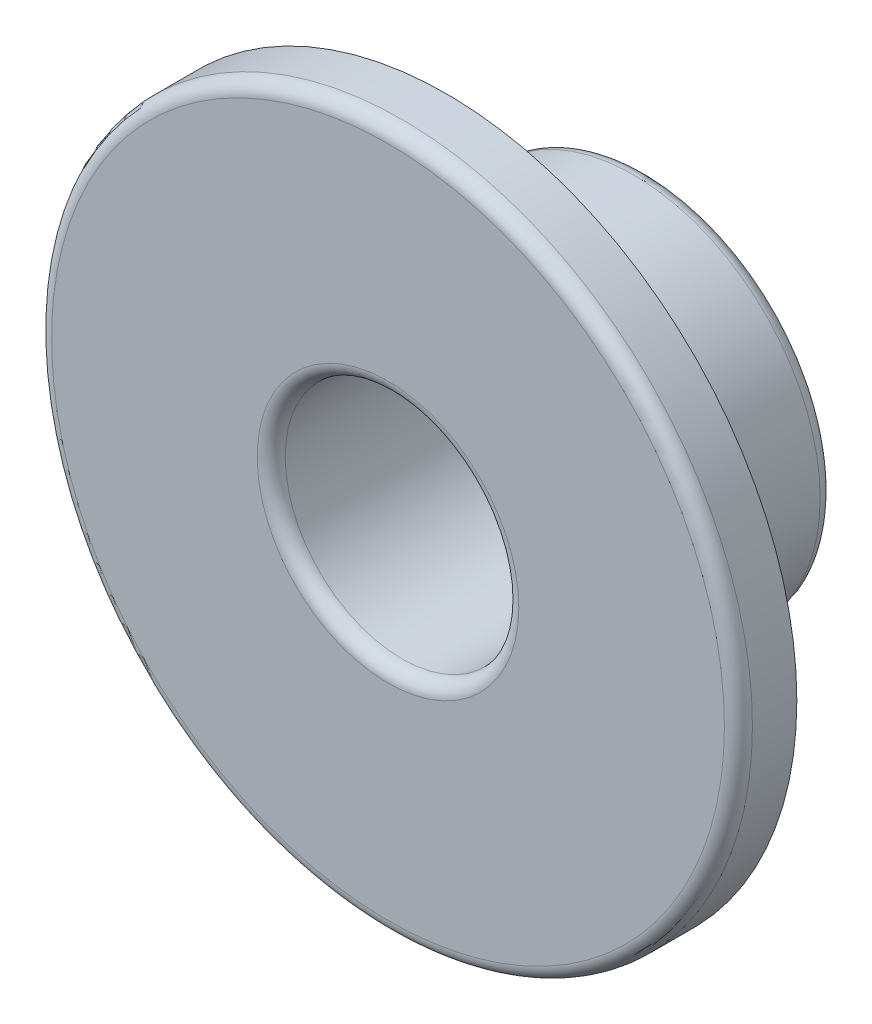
ISO-10303-21;
HEADER;
FILE_DESCRIPTION(('STEP AP214'),'2;1');
FILE_NAME('part.step','',(''),(''),'','','');
FILE_SCHEMA(('AUTOMOTIVE_DESIGN { 1 0 10303 214 1 1 1 1 }'));
ENDSEC;
DATA;
#1=APPLICATION_CONTEXT('core data for automotive mechanical design processes');
#2=APPLICATION_PROTOCOL_DEFINITION('international standard','automotive_design',2000,#1);
#3=PRODUCT_CONTEXT('',#1,'mechanical');
#4=PRODUCT('Part','Part','',(#3));
#5=PRODUCT_RELATED_PRODUCT_CATEGORY('part','',(#4));
#6=PRODUCT_DEFINITION_FORMATION('','',#4);
#7=PRODUCT_DEFINITION_CONTEXT('part definition',#1,'design');
#8=PRODUCT_DEFINITION('design','',#6,#7);
#9=PRODUCT_DEFINITION_SHAPE('','',#8);
#10=(LENGTH_UNIT() NAMED_UNIT(*) SI_UNIT(.MILLI.,.METRE.));
#11=(NAMED_UNIT(*) PLANE_ANGLE_UNIT() SI_UNIT($,.RADIAN.));
#12=(NAMED_UNIT(*) SI_UNIT($,.STERADIAN.) SOLID_ANGLE_UNIT());
#13=UNCERTAINTY_MEASURE_WITH_UNIT(LENGTH_MEASURE(1.E-05),#10,'distance_accuracy_value','');
#14=(GEOMETRIC_REPRESENTATION_CONTEXT(3) GLOBAL_UNCERTAINTY_ASSIGNED_CONTEXT((#13)) GLOBAL_UNIT_ASSIGNED_CONTEXT((#10,
#11,#12)) REPRESENTATION_CONTEXT('',''));
#15=CARTESIAN_POINT('',(0.,0.,0.));
#16=DIRECTION('',(0.,0.,1.));
#17=DIRECTION('',(1.,0.,0.));
#18=AXIS2_PLACEMENT_3D('',#15,#16,#17);
#19=CARTESIAN_POINT('',(0.,0.,0.));
#20=DIRECTION('',(0.,0.,1.));
#21=DIRECTION('',(1.,0.,0.));
#22=AXIS2_PLACEMENT_3D('',#19,#20,#21);
#23=PLANE('',#22);
#24=CARTESIAN_POINT('',(0.,0.,0.));
#25=DIRECTION('',(0.,0.,1.));
#26=DIRECTION('',(1.,0.,0.));
#27=AXIS2_PLACEMENT_3D('',#24,#25,#26);
#28=CIRCLE('',#27,19.05);
#29=CARTESIAN_POINT('',(19.05,0.,0.));
#30=VERTEX_POINT('',#29);
#31=EDGE_CURVE('E65',#30,#30,#28,.T.);
#32=ORIENTED_EDGE('',*,*,#31,.F.);
#33=EDGE_LOOP('',(#32));
#34=FACE_BOUND('',#33,.T.);
#35=CARTESIAN_POINT('',(0.,0.,0.));
#36=DIRECTION('',(0.,0.,1.));
#37=DIRECTION('',(1.,0.,0.));
#38=AXIS2_PLACEMENT_3D('',#35,#36,#37);
#39=CIRCLE('',#38,10.16);
#40=CARTESIAN_POINT('',(10.16,0.,0.));
#41=VERTEX_POINT('',#40);
#42=EDGE_CURVE('E62',#41,#41,#39,.F.);
#43=ORIENTED_EDGE('',*,*,#42,.F.);
#44=EDGE_LOOP('',(#43));
#45=FACE_BOUND('',#44,.T.);
#46=ADVANCED_FACE('F30',(#34,#45),#23,.F.);
#47=CARTESIAN_POINT('',(0.,0.,3.175));
#48=DIRECTION('',(0.,0.,-1.));
#49=DIRECTION('',(-1.,0.,0.));
#50=AXIS2_PLACEMENT_3D('',#47,#48,#49);
#51=CYLINDRICAL_SURFACE('',#50,19.05);
#52=CARTESIAN_POINT('',(0.,0.,2.413));
#53=DIRECTION('',(0.,0.,1.));
#54=DIRECTION('',(1.,0.,0.));
#55=AXIS2_PLACEMENT_3D('',#52,#53,#54);
#56=CIRCLE('',#55,19.05);
#57=CARTESIAN_POINT('',(19.05,0.,2.413));
#58=VERTEX_POINT('',#57);
#59=EDGE_CURVE('E37',#58,#58,#56,.F.);
#60=ORIENTED_EDGE('',*,*,#59,.T.);
#61=EDGE_LOOP('',(#60));
#62=FACE_BOUND('',#61,.T.);
#63=ORIENTED_EDGE('',*,*,#31,.T.);
#64=EDGE_LOOP('',(#63));
#65=FACE_BOUND('',#64,.T.);
#66=ADVANCED_FACE('F32',(#62,#65),#51,.T.);
#67=CARTESIAN_POINT('',(0.,0.,3.175));
#68=DIRECTION('',(0.,0.,1.));
#69=DIRECTION('',(1.,0.,0.));
#70=AXIS2_PLACEMENT_3D('',#67,#68,#69);
#71=PLANE('',#70);
#72=CARTESIAN_POINT('',(0.,0.,3.175));
#73=DIRECTION('',(0.,0.,1.));
#74=DIRECTION('',(1.,0.,0.));
#75=AXIS2_PLACEMENT_3D('',#72,#73,#74);
#76=CIRCLE('',#75,7.112);
#77=CARTESIAN_POINT('',(7.112,0.,3.175));
#78=VERTEX_POINT('',#77);
#79=EDGE_CURVE('E50',#78,#78,#76,.F.);
#80=ORIENTED_EDGE('',*,*,#79,.T.);
#81=EDGE_LOOP('',(#80));
#82=FACE_BOUND('',#81,.T.);
#83=CARTESIAN_POINT('',(0.,0.,3.175));
#84=DIRECTION('',(0.,0.,1.));
#85=DIRECTION('',(1.,0.,0.));
#86=AXIS2_PLACEMENT_3D('',#83,#84,#85);
#87=CIRCLE('',#86,18.288);
#88=CARTESIAN_POINT('',(18.288,0.,3.175));
#89=VERTEX_POINT('',#88);
#90=EDGE_CURVE('E53',#89,#89,#87,.T.);
#91=ORIENTED_EDGE('',*,*,#90,.T.);
#92=EDGE_LOOP('',(#91));
#93=FACE_BOUND('',#92,.T.);
#94=ADVANCED_FACE('F78',(#82,#93),#71,.T.);
#95=CARTESIAN_POINT('',(0.,0.,-10.922));
#96=DIRECTION('',(0.,0.,1.));
#97=DIRECTION('',(1.,0.,0.));
#98=AXIS2_PLACEMENT_3D('',#95,#96,#97);
#99=CYLINDRICAL_SURFACE('',#98,10.16);
#100=CARTESIAN_POINT('',(0.,0.,-10.16));
#101=DIRECTION('',(0.,0.,-1.));
#102=DIRECTION('',(-1.,0.,0.));
#103=AXIS2_PLACEMENT_3D('',#100,#101,#102);
#104=CIRCLE('',#103,10.16);
#105=CARTESIAN_POINT('',(-10.16,0.,-10.16));
#106=VERTEX_POINT('',#105);
#107=EDGE_CURVE('E10',#106,#106,#104,.F.);
#108=ORIENTED_EDGE('',*,*,#107,.T.);
#109=EDGE_LOOP('',(#108));
#110=FACE_BOUND('',#109,.T.);
#111=ORIENTED_EDGE('',*,*,#42,.T.);
#112=EDGE_LOOP('',(#111));
#113=FACE_BOUND('',#112,.T.);
#114=ADVANCED_FACE('F75',(#110,#113),#99,.T.);
#115=CARTESIAN_POINT('',(0.,0.,-10.922));
#116=DIRECTION('',(0.,0.,-1.));
#117=DIRECTION('',(-1.,0.,0.));
#118=AXIS2_PLACEMENT_3D('',#115,#116,#117);
#119=PLANE('',#118);
#120=CARTESIAN_POINT('',(0.,0.,-10.922));
#121=DIRECTION('',(0.,0.,-1.));
#122=DIRECTION('',(-1.,0.,0.));
#123=AXIS2_PLACEMENT_3D('',#120,#121,#122);
#124=CIRCLE('',#123,7.112);
#125=CARTESIAN_POINT('',(-7.112,0.,-10.922));
#126=VERTEX_POINT('',#125);
#127=EDGE_CURVE('E41',#126,#126,#124,.F.);
#128=ORIENTED_EDGE('',*,*,#127,.T.);
#129=EDGE_LOOP('',(#128));
#130=FACE_BOUND('',#129,.T.);
#131=CARTESIAN_POINT('',(0.,0.,-10.922));
#132=DIRECTION('',(0.,0.,-1.));
#133=DIRECTION('',(-1.,0.,0.));
#134=AXIS2_PLACEMENT_3D('',#131,#132,#133);
#135=CIRCLE('',#134,9.398);
#136=CARTESIAN_POINT('',(-9.398,0.,-10.922));
#137=VERTEX_POINT('',#136);
#138=EDGE_CURVE('E45',#137,#137,#135,.T.);
#139=ORIENTED_EDGE('',*,*,#138,.T.);
#140=EDGE_LOOP('',(#139));
#141=FACE_BOUND('',#140,.T.);
#142=ADVANCED_FACE('F77',(#130,#141),#119,.T.);
#143=CARTESIAN_POINT('',(0.,0.,-10.922));
#144=DIRECTION('',(0.,0.,1.));
#145=DIRECTION('',(1.,0.,0.));
#146=AXIS2_PLACEMENT_3D('',#143,#144,#145);
#147=CYLINDRICAL_SURFACE('',#146,6.35);
#148=CARTESIAN_POINT('',(0.,0.,2.413));
#149=DIRECTION('',(0.,0.,1.));
#150=DIRECTION('',(1.,0.,0.));
#151=AXIS2_PLACEMENT_3D('',#148,#149,#150);
#152=CIRCLE('',#151,6.35);
#153=CARTESIAN_POINT('',(6.35,0.,2.413));
#154=VERTEX_POINT('',#153);
#155=EDGE_CURVE('E56',#154,#154,#152,.T.);
#156=ORIENTED_EDGE('',*,*,#155,.T.);
#157=EDGE_LOOP('',(#156));
#158=FACE_BOUND('',#157,.T.);
#159=CARTESIAN_POINT('',(0.,0.,-10.16));
#160=DIRECTION('',(0.,0.,-1.));
#161=DIRECTION('',(-1.,0.,0.));
#162=AXIS2_PLACEMENT_3D('',#159,#160,#161);
#163=CIRCLE('',#162,6.35);
#164=CARTESIAN_POINT('',(-6.35,0.,-10.16));
#165=VERTEX_POINT('',#164);
#166=EDGE_CURVE('E59',#165,#165,#163,.T.);
#167=ORIENTED_EDGE('',*,*,#166,.T.);
#168=EDGE_LOOP('',(#167));
#169=FACE_BOUND('',#168,.T.);
#170=ADVANCED_FACE('F84',(#158,#169),#147,.F.);
#171=CARTESIAN_POINT('',(0.,0.,2.413));
#172=DIRECTION('',(0.,0.,1.));
#173=DIRECTION('',(1.,0.,0.));
#174=AXIS2_PLACEMENT_3D('',#171,#172,#173);
#175=TOROIDAL_SURFACE('',#174,7.112,0.762);
#176=ORIENTED_EDGE('',*,*,#79,.F.);
#177=EDGE_LOOP('',(#176));
#178=FACE_BOUND('',#177,.T.);
#179=ORIENTED_EDGE('',*,*,#155,.F.);
#180=EDGE_LOOP('',(#179));
#181=FACE_BOUND('',#180,.T.);
#182=ADVANCED_FACE('F91',(#178,#181),#175,.T.);
#183=CARTESIAN_POINT('',(0.,0.,-10.16));
#184=DIRECTION('',(0.,0.,-1.));
#185=DIRECTION('',(-1.,0.,0.));
#186=AXIS2_PLACEMENT_3D('',#183,#184,#185);
#187=TOROIDAL_SURFACE('',#186,7.112,0.762);
#188=ORIENTED_EDGE('',*,*,#166,.F.);
#189=EDGE_LOOP('',(#188));
#190=FACE_BOUND('',#189,.T.);
#191=ORIENTED_EDGE('',*,*,#127,.F.);
#192=EDGE_LOOP('',(#191));
#193=FACE_BOUND('',#192,.T.);
#194=ADVANCED_FACE('F95',(#190,#193),#187,.T.);
#195=CARTESIAN_POINT('',(0.,0.,2.413));
#196=DIRECTION('',(0.,0.,1.));
#197=DIRECTION('',(1.,0.,0.));
#198=AXIS2_PLACEMENT_3D('',#195,#196,#197);
#199=TOROIDAL_SURFACE('',#198,18.288,0.762);
#200=ORIENTED_EDGE('',*,*,#59,.F.);
#201=EDGE_LOOP('',(#200));
#202=FACE_BOUND('',#201,.T.);
#203=ORIENTED_EDGE('',*,*,#90,.F.);
#204=EDGE_LOOP('',(#203));
#205=FACE_BOUND('',#204,.T.);
#206=ADVANCED_FACE('F99',(#202,#205),#199,.T.);
#207=CARTESIAN_POINT('',(0.,0.,-10.16));
#208=DIRECTION('',(0.,0.,-1.));
#209=DIRECTION('',(-1.,0.,0.));
#210=AXIS2_PLACEMENT_3D('',#207,#208,#209);
#211=TOROIDAL_SURFACE('',#210,9.398,0.762);
#212=ORIENTED_EDGE('',*,*,#107,.F.);
#213=EDGE_LOOP('',(#212));
#214=FACE_BOUND('',#213,.T.);
#215=ORIENTED_EDGE('',*,*,#138,.F.);
#216=EDGE_LOOP('',(#215));
#217=FACE_BOUND('',#216,.T.);
#218=ADVANCED_FACE('F103',(#214,#217),#211,.T.);
#219=CLOSED_SHELL('',(#46,#66,#94,#114,#142,#170,#182,#194,#206,#218));
#220=MANIFOLD_SOLID_BREP('B2',#219);
#221=ADVANCED_BREP_SHAPE_REPRESENTATION('',(#18,#220),#14);
#222=SHAPE_DEFINITION_REPRESENTATION(#9,#221);
ENDSEC;
END-ISO-10303-21;
